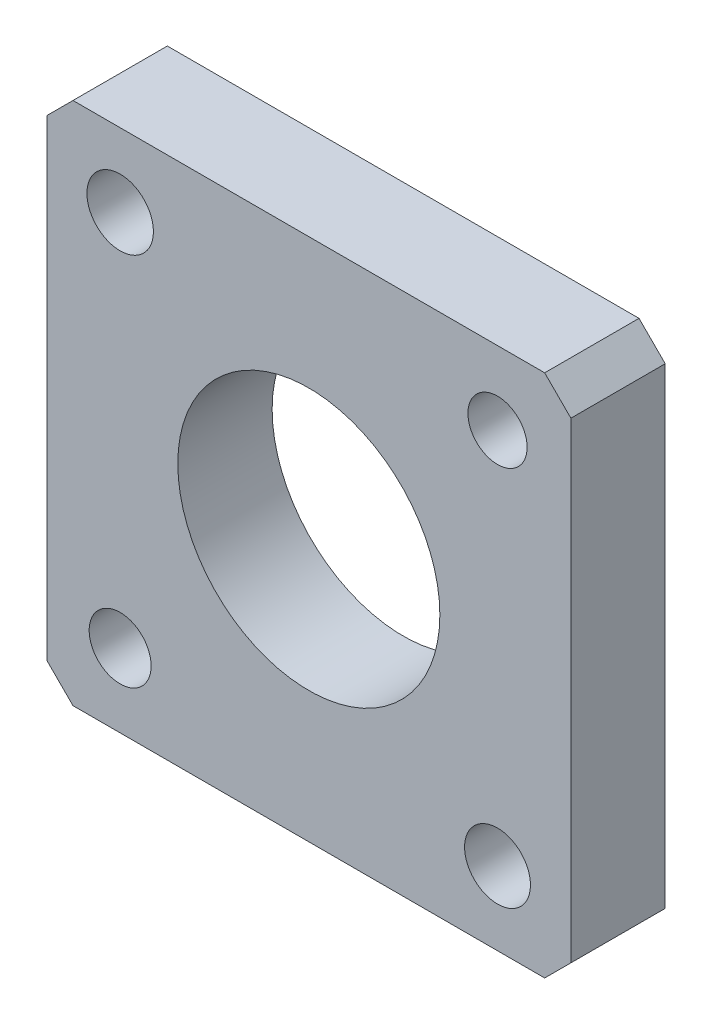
from build123d import *

# Parameters (mm, degrees)
ESQUISSE1_W             = 100
ESQUISSE1_H             = 100
BASE_EXTRUSION_DEPTH    = 18
CHANFREIN1_SIZE         = 5
ESQUISSE2_R             = 25
ESQUISSE2_R_2           = 5.648300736
ESQUISSE2_R_3           = 6.344128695
ESQUISSE2_R_4           = 5.909510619
ESQUISSE2_R_5           = 6.284815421
ENL_V_MAT_EXTRU_1_DEPTH = 18


with BuildPart() as part:
    # Esquisse1 → Base-Extrusion (new body)
    with BuildSketch(Plane.XY):
        with Locations((-40.120775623, 23.262465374)):
            Rectangle(ESQUISSE1_W, ESQUISSE1_H)
    extrude(amount=BASE_EXTRUSION_DEPTH)

    # Chanfrein1
    chanfrein1_edges = [part.edges().sort_by_distance(p)[0] for p in [
        (-90.120775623, 73.262465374, 9),
        (9.879224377, 73.262465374, 9),
        (9.879224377, -26.737534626, 9),
        (-90.120775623, -26.737534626, 9),
    ]]
    chamfer(chanfrein1_edges, length=CHANFREIN1_SIZE)

    # Esquisse2 → Enl_v. mat.-Extru.1 (cut)
    with BuildSketch(Plane.XY.offset(18)):
        with Locations((-40.120775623, 23.262465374)):
            Circle(ESQUISSE2_R)
        with Locations((-4.120775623, 59.262465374)):
            Circle(ESQUISSE2_R_2)
        with Locations((-76.120775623, 59.262465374)):
            Circle(ESQUISSE2_R_3)
        with Locations((-76.120775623, -12.737534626)):
            Circle(ESQUISSE2_R_4)
        with Locations((-4.120775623, -12.737534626)):
            Circle(ESQUISSE2_R_5)
    extrude(amount=-ENL_V_MAT_EXTRU_1_DEPTH, mode=Mode.SUBTRACT)


solid = part.part
